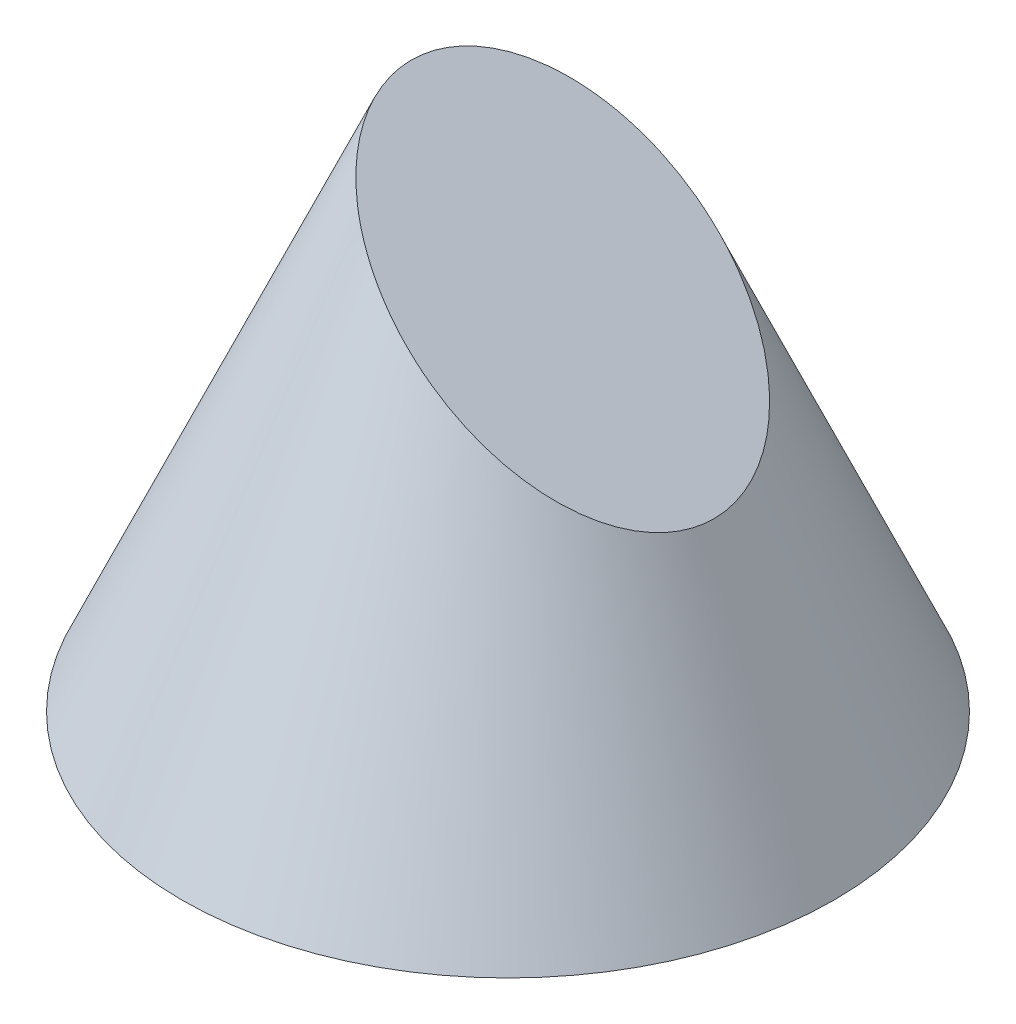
from build123d import *

# Parameters (mm, degrees)
CUT_EXTRUDE1_DEPTH      = 50.016875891
CUT_EXTRUDE1_DEPTH_BACK = 50.016875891


with BuildPart() as part:
    # Extrude1 cone 1 section (on through the dimple's axis) → Extrude1 (revolve)
    with BuildSketch(Plane(origin=(0, 0, 0), x_dir=(0, 0, -1), z_dir=(1, 0, 0))):
        Polygon((0, 0), (18.467791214, 0), (0, 41.4793382), align=None)
    revolve(axis=Axis((0, 0, 0), (0, 1, 0)))

    # Sketch2 → Cut-Extrude1 (cut, two sides: drawn at the far end of the back side and taken through both)
    with BuildSketch(Plane.XY.offset(-CUT_EXTRUDE1_DEPTH_BACK)):
        Polygon((-93.025426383, 100.361213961), (-7.821518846, 31.118538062), (19.40384835, 8.993293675), (104.607755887, -60.249382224), (243.093107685, 110.158432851), (45.459925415, 270.769029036), align=None)
    extrude(amount=CUT_EXTRUDE1_DEPTH + CUT_EXTRUDE1_DEPTH_BACK, mode=Mode.SUBTRACT)


solid = part.part
